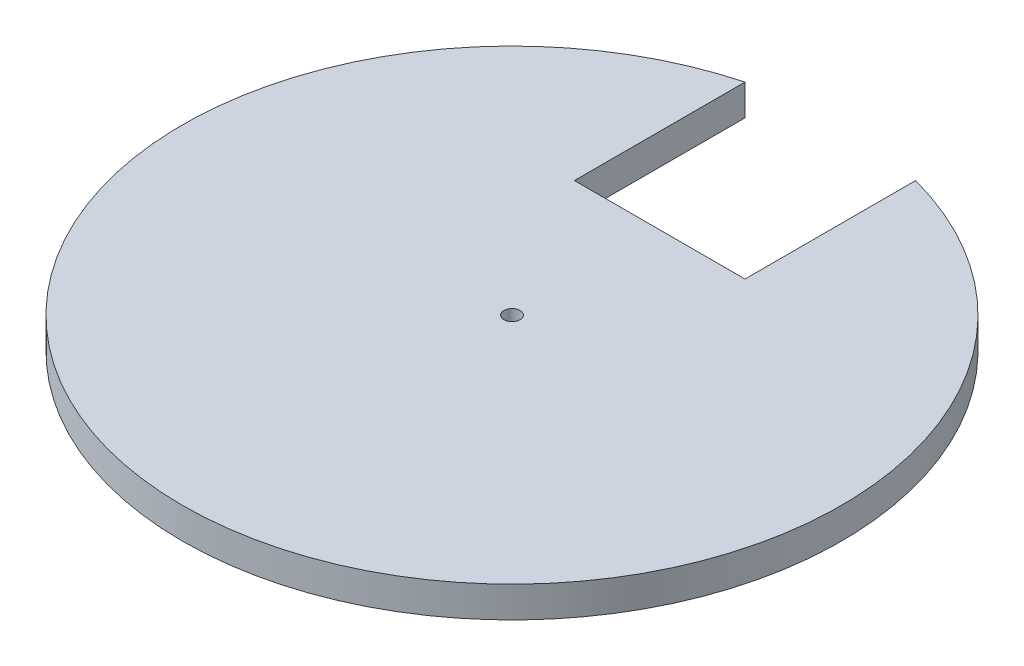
ISO-10303-21;
HEADER;
FILE_DESCRIPTION(('STEP AP214'),'2;1');
FILE_NAME('part.step','',(''),(''),'','','');
FILE_SCHEMA(('AUTOMOTIVE_DESIGN { 1 0 10303 214 1 1 1 1 }'));
ENDSEC;
DATA;
#1=APPLICATION_CONTEXT('core data for automotive mechanical design processes');
#2=APPLICATION_PROTOCOL_DEFINITION('international standard','automotive_design',2000,#1);
#3=PRODUCT_CONTEXT('',#1,'mechanical');
#4=PRODUCT('Part','Part','',(#3));
#5=PRODUCT_RELATED_PRODUCT_CATEGORY('part','',(#4));
#6=PRODUCT_DEFINITION_FORMATION('','',#4);
#7=PRODUCT_DEFINITION_CONTEXT('part definition',#1,'design');
#8=PRODUCT_DEFINITION('design','',#6,#7);
#9=PRODUCT_DEFINITION_SHAPE('','',#8);
#10=(LENGTH_UNIT() NAMED_UNIT(*) SI_UNIT(.MILLI.,.METRE.));
#11=(NAMED_UNIT(*) PLANE_ANGLE_UNIT() SI_UNIT($,.RADIAN.));
#12=(NAMED_UNIT(*) SI_UNIT($,.STERADIAN.) SOLID_ANGLE_UNIT());
#13=UNCERTAINTY_MEASURE_WITH_UNIT(LENGTH_MEASURE(1.E-05),#10,'distance_accuracy_value','');
#14=(GEOMETRIC_REPRESENTATION_CONTEXT(3) GLOBAL_UNCERTAINTY_ASSIGNED_CONTEXT((#13)) GLOBAL_UNIT_ASSIGNED_CONTEXT((#10,
#11,#12)) REPRESENTATION_CONTEXT('',''));
#15=CARTESIAN_POINT('',(0.,0.,0.));
#16=DIRECTION('',(0.,0.,1.));
#17=DIRECTION('',(1.,0.,0.));
#18=AXIS2_PLACEMENT_3D('',#15,#16,#17);
#19=CARTESIAN_POINT('',(0.,10.,-55.));
#20=DIRECTION('',(-1.,0.,0.));
#21=DIRECTION('',(0.,0.,1.));
#22=AXIS2_PLACEMENT_3D('',#19,#20,#21);
#23=PLANE('',#22);
#24=DIRECTION('',(0.,0.,-1.));
#25=VECTOR('',#24,1.);
#26=CARTESIAN_POINT('',(0.,0.,-55.));
#27=LINE('',#26,#25);
#28=CARTESIAN_POINT('',(0.,0.,0.));
#29=VERTEX_POINT('',#28);
#30=CARTESIAN_POINT('',(0.,0.,-55.));
#31=VERTEX_POINT('',#30);
#32=EDGE_CURVE('E95',#29,#31,#27,.T.);
#33=ORIENTED_EDGE('',*,*,#32,.T.);
#34=DIRECTION('',(0.,-1.,0.));
#35=VECTOR('',#34,1.);
#36=CARTESIAN_POINT('',(0.,10.,-55.));
#37=LINE('',#36,#35);
#38=CARTESIAN_POINT('',(0.,10.,-55.));
#39=VERTEX_POINT('',#38);
#40=EDGE_CURVE('E11',#39,#31,#37,.T.);
#41=ORIENTED_EDGE('',*,*,#40,.F.);
#42=DIRECTION('',(0.,0.,-1.));
#43=VECTOR('',#42,1.);
#44=CARTESIAN_POINT('',(0.,10.,-55.));
#45=LINE('',#44,#43);
#46=CARTESIAN_POINT('',(0.,10.,0.));
#47=VERTEX_POINT('',#46);
#48=EDGE_CURVE('E83',#47,#39,#45,.T.);
#49=ORIENTED_EDGE('',*,*,#48,.F.);
#50=DIRECTION('',(0.,-1.,0.));
#51=VECTOR('',#50,1.);
#52=CARTESIAN_POINT('',(0.,10.,0.));
#53=LINE('',#52,#51);
#54=EDGE_CURVE('E91',#47,#29,#53,.T.);
#55=ORIENTED_EDGE('',*,*,#54,.T.);
#56=EDGE_LOOP('',(#33,#41,#49,#55));
#57=FACE_BOUND('',#56,.T.);
#58=ADVANCED_FACE('F32',(#57),#23,.F.);
#59=CARTESIAN_POINT('',(27.5,10.,47.6313972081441));
#60=DIRECTION('',(0.,-1.,0.));
#61=DIRECTION('',(0.,0.,-1.));
#62=AXIS2_PLACEMENT_3D('',#59,#60,#61);
#63=CYLINDRICAL_SURFACE('',#62,106.251840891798);
#64=CARTESIAN_POINT('',(27.5,0.,47.6313972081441));
#65=DIRECTION('',(0.,1.,0.));
#66=DIRECTION('',(0.,0.,1.));
#67=AXIS2_PLACEMENT_3D('',#64,#65,#66);
#68=CIRCLE('',#67,106.251840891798);
#69=CARTESIAN_POINT('',(55.,0.,-55.));
#70=VERTEX_POINT('',#69);
#71=EDGE_CURVE('E87',#31,#70,#68,.T.);
#72=ORIENTED_EDGE('',*,*,#71,.T.);
#73=DIRECTION('',(0.,-1.,0.));
#74=VECTOR('',#73,1.);
#75=CARTESIAN_POINT('',(55.,10.,-55.));
#76=LINE('',#75,#74);
#77=CARTESIAN_POINT('',(55.,10.,-55.));
#78=VERTEX_POINT('',#77);
#79=EDGE_CURVE('E40',#78,#70,#76,.T.);
#80=ORIENTED_EDGE('',*,*,#79,.F.);
#81=CARTESIAN_POINT('',(27.5,10.,47.6313972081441));
#82=DIRECTION('',(0.,1.,0.));
#83=DIRECTION('',(0.,0.,1.));
#84=AXIS2_PLACEMENT_3D('',#81,#82,#83);
#85=CIRCLE('',#84,106.251840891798);
#86=EDGE_CURVE('E78',#39,#78,#85,.T.);
#87=ORIENTED_EDGE('',*,*,#86,.F.);
#88=ORIENTED_EDGE('',*,*,#40,.T.);
#89=EDGE_LOOP('',(#72,#80,#87,#88));
#90=FACE_BOUND('',#89,.T.);
#91=ADVANCED_FACE('F86',(#90),#63,.T.);
#92=CARTESIAN_POINT('',(55.,10.,0.));
#93=DIRECTION('',(1.,0.,0.));
#94=DIRECTION('',(0.,0.,-1.));
#95=AXIS2_PLACEMENT_3D('',#92,#93,#94);
#96=PLANE('',#95);
#97=DIRECTION('',(0.,0.,1.));
#98=VECTOR('',#97,1.);
#99=CARTESIAN_POINT('',(55.,0.,0.));
#100=LINE('',#99,#98);
#101=CARTESIAN_POINT('',(55.,0.,0.));
#102=VERTEX_POINT('',#101);
#103=EDGE_CURVE('E65',#70,#102,#100,.T.);
#104=ORIENTED_EDGE('',*,*,#103,.T.);
#105=DIRECTION('',(0.,-1.,0.));
#106=VECTOR('',#105,1.);
#107=CARTESIAN_POINT('',(55.,10.,0.));
#108=LINE('',#107,#106);
#109=CARTESIAN_POINT('',(55.,10.,0.));
#110=VERTEX_POINT('',#109);
#111=EDGE_CURVE('E88',#110,#102,#108,.T.);
#112=ORIENTED_EDGE('',*,*,#111,.F.);
#113=DIRECTION('',(0.,0.,1.));
#114=VECTOR('',#113,1.);
#115=CARTESIAN_POINT('',(55.,10.,0.));
#116=LINE('',#115,#114);
#117=EDGE_CURVE('E81',#78,#110,#116,.T.);
#118=ORIENTED_EDGE('',*,*,#117,.F.);
#119=ORIENTED_EDGE('',*,*,#79,.T.);
#120=EDGE_LOOP('',(#104,#112,#118,#119));
#121=FACE_BOUND('',#120,.T.);
#122=ADVANCED_FACE('F89',(#121),#96,.F.);
#123=CARTESIAN_POINT('',(0.,10.,0.));
#124=DIRECTION('',(0.,0.,1.));
#125=DIRECTION('',(1.,0.,0.));
#126=AXIS2_PLACEMENT_3D('',#123,#124,#125);
#127=PLANE('',#126);
#128=DIRECTION('',(-1.,0.,0.));
#129=VECTOR('',#128,1.);
#130=CARTESIAN_POINT('',(0.,0.,0.));
#131=LINE('',#130,#129);
#132=EDGE_CURVE('E71',#102,#29,#131,.T.);
#133=ORIENTED_EDGE('',*,*,#132,.T.);
#134=ORIENTED_EDGE('',*,*,#54,.F.);
#135=DIRECTION('',(-1.,0.,0.));
#136=VECTOR('',#135,1.);
#137=CARTESIAN_POINT('',(0.,10.,0.));
#138=LINE('',#137,#136);
#139=EDGE_CURVE('E48',#110,#47,#138,.T.);
#140=ORIENTED_EDGE('',*,*,#139,.F.);
#141=ORIENTED_EDGE('',*,*,#111,.T.);
#142=EDGE_LOOP('',(#133,#134,#140,#141));
#143=FACE_BOUND('',#142,.T.);
#144=ADVANCED_FACE('F103',(#143),#127,.F.);
#145=CARTESIAN_POINT('',(27.5,10.,47.6313972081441));
#146=DIRECTION('',(0.,1.,0.));
#147=DIRECTION('',(0.,0.,1.));
#148=AXIS2_PLACEMENT_3D('',#145,#146,#147);
#149=PLANE('',#148);
#150=CARTESIAN_POINT('',(27.5,10.,47.6313972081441));
#151=DIRECTION('',(0.,1.,0.));
#152=DIRECTION('',(0.,0.,1.));
#153=AXIS2_PLACEMENT_3D('',#150,#151,#152);
#154=CIRCLE('',#153,2.6);
#155=CARTESIAN_POINT('',(27.5,10.,50.2313972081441));
#156=VERTEX_POINT('',#155);
#157=EDGE_CURVE('E109',#156,#156,#154,.T.);
#158=ORIENTED_EDGE('',*,*,#157,.F.);
#159=EDGE_LOOP('',(#158));
#160=FACE_BOUND('',#159,.T.);
#161=ORIENTED_EDGE('',*,*,#48,.T.);
#162=ORIENTED_EDGE('',*,*,#86,.T.);
#163=ORIENTED_EDGE('',*,*,#117,.T.);
#164=ORIENTED_EDGE('',*,*,#139,.T.);
#165=EDGE_LOOP('',(#161,#162,#163,#164));
#166=FACE_BOUND('',#165,.T.);
#167=ADVANCED_FACE('F79',(#160,#166),#149,.T.);
#168=CARTESIAN_POINT('',(27.5,0.,47.6313972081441));
#169=DIRECTION('',(0.,1.,0.));
#170=DIRECTION('',(0.,0.,1.));
#171=AXIS2_PLACEMENT_3D('',#168,#169,#170);
#172=PLANE('',#171);
#173=CARTESIAN_POINT('',(27.5,0.,47.6313972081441));
#174=DIRECTION('',(0.,1.,0.));
#175=DIRECTION('',(0.,0.,1.));
#176=AXIS2_PLACEMENT_3D('',#173,#174,#175);
#177=CIRCLE('',#176,2.6);
#178=CARTESIAN_POINT('',(27.5,0.,50.2313972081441));
#179=VERTEX_POINT('',#178);
#180=EDGE_CURVE('E98',#179,#179,#177,.T.);
#181=ORIENTED_EDGE('',*,*,#180,.T.);
#182=EDGE_LOOP('',(#181));
#183=FACE_BOUND('',#182,.T.);
#184=ORIENTED_EDGE('',*,*,#32,.F.);
#185=ORIENTED_EDGE('',*,*,#132,.F.);
#186=ORIENTED_EDGE('',*,*,#103,.F.);
#187=ORIENTED_EDGE('',*,*,#71,.F.);
#188=EDGE_LOOP('',(#184,#185,#186,#187));
#189=FACE_BOUND('',#188,.T.);
#190=ADVANCED_FACE('F106',(#183,#189),#172,.F.);
#191=CARTESIAN_POINT('',(27.5,0.,47.6313972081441));
#192=DIRECTION('',(0.,1.,0.));
#193=DIRECTION('',(0.,0.,1.));
#194=AXIS2_PLACEMENT_3D('',#191,#192,#193);
#195=CYLINDRICAL_SURFACE('',#194,2.6);
#196=ORIENTED_EDGE('',*,*,#180,.F.);
#197=EDGE_LOOP('',(#196));
#198=FACE_BOUND('',#197,.T.);
#199=ORIENTED_EDGE('',*,*,#157,.T.);
#200=EDGE_LOOP('',(#199));
#201=FACE_BOUND('',#200,.T.);
#202=ADVANCED_FACE('F116',(#198,#201),#195,.F.);
#203=CLOSED_SHELL('',(#58,#91,#122,#144,#167,#190,#202));
#204=MANIFOLD_SOLID_BREP('B2',#203);
#205=ADVANCED_BREP_SHAPE_REPRESENTATION('',(#18,#204),#14);
#206=SHAPE_DEFINITION_REPRESENTATION(#9,#205);
ENDSEC;
END-ISO-10303-21;
